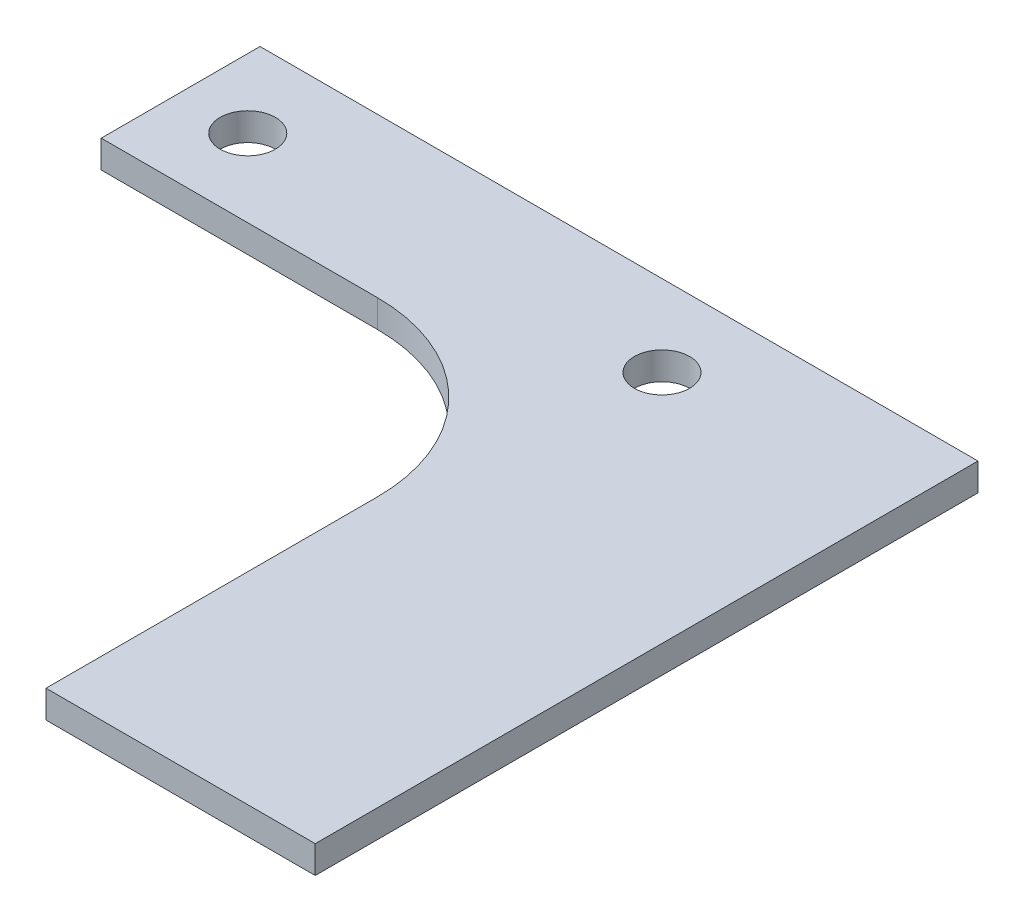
from build123d import *

# Parameters (mm, degrees)
BOSS_EXTRUDE1_DEPTH = 1.5875
SKETCH5_R           = 1.5875
CUT_EXTRUDE2_DEPTH  = 57.818308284
CUT_EXTRUDE3_DEPTH  = 57.818308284


with BuildPart() as part:
    # Sketch1 → Boss-Extrude1 (new body)
    with BuildSketch(Plane(origin=(0, 0, 0), x_dir=(1, 0, 0), z_dir=(0, 1, 0))):
        with BuildLine():
            Line((25.4, 19.05), (-15.875, 19.05))
            Line((-15.875, 19.05), (-15.875, 9.921875))
            Line((-15.875, 9.921875), (0, 9.921875))
            ThreePointArc((0, 9.921875), (7.015825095, 7.015825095), (9.921875, 0))
            ThreePointArc((9.921875, 0), (7.015825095, -7.015825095), (0, -9.921875))
            Line((0, -9.921875), (-25.4, -9.921875))
            Line((-25.4, -9.921875), (-25.4, -50.8))
            Line((-25.4, -50.8), (25.4, -50.8))
            Line((25.4, -50.8), (25.4, 19.05))
        make_face()
    extrude(amount=BOSS_EXTRUDE1_DEPTH)

    # Sketch5 → Cut-Extrude2 (cut, through all)
    with BuildSketch(Plane(origin=(0, 1.5875, 0), x_dir=(1, 0, 0), z_dir=(0, 1, 0))):
        with Locations(Location((11.90625, 14.3764, 0), (0, 0, 270))):
            Circle(SKETCH5_R)
        with Locations(Location((-11.90625, 14.3764, 0), (0, 0, 270))):
            Circle(SKETCH5_R)
        with Locations(Location((-11.1125, -15.875, 0), (0, 0, 270))):
            Circle(SKETCH5_R)
    extrude(amount=-CUT_EXTRUDE2_DEPTH, mode=Mode.SUBTRACT)

    # Sketch6 → Cut-Extrude3 (cut, through all)
    with BuildSketch(Plane(origin=(0, 1.5875, 0), x_dir=(1, 0, 0), z_dir=(0, 1, 0))):
        Polygon((31.705394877, -55.195798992), (-44.109057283, -55.195798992), (-44.109057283, 0), (9.921875, 0), (9.921875, -19.05), (31.705394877, -19.05), align=None)
    extrude(amount=-CUT_EXTRUDE3_DEPTH, mode=Mode.SUBTRACT)


solid = part.part
